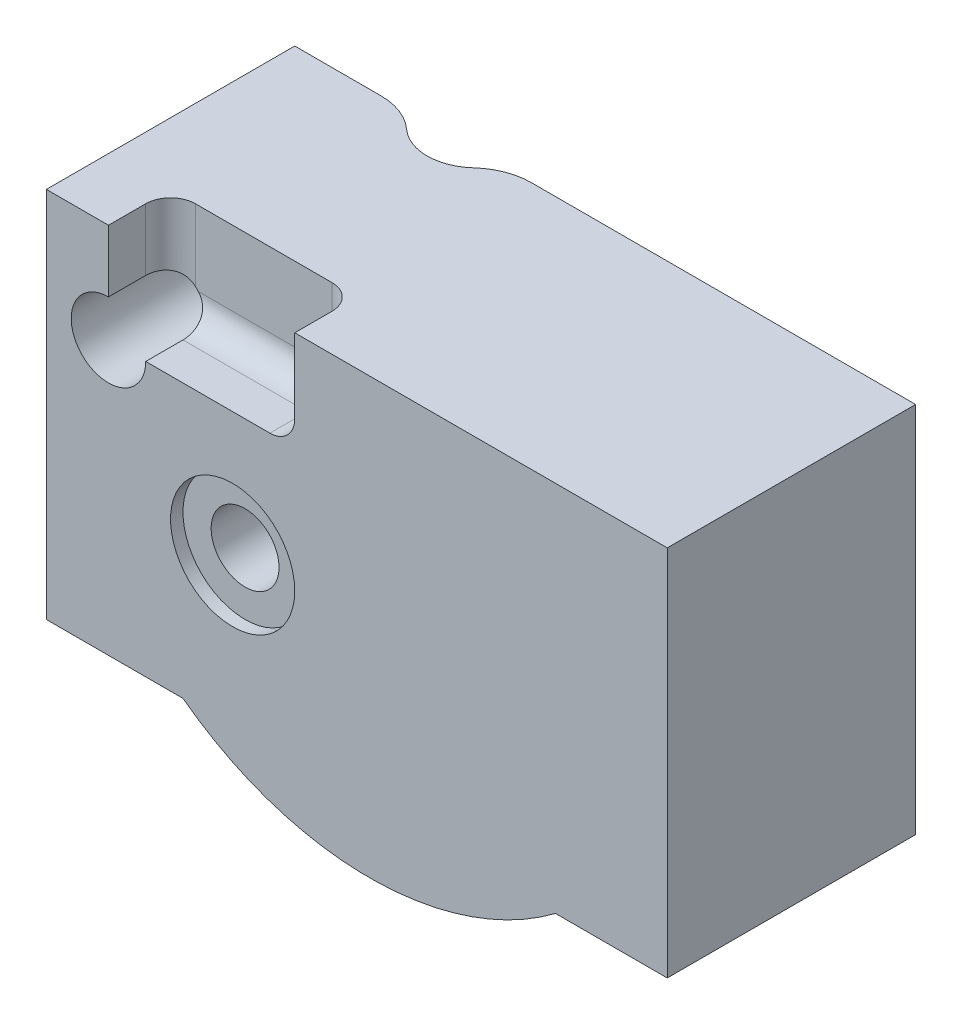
from build123d import *

# Parameters (mm, degrees)
EXTRUDE_1_DEPTH                  = 20
SKETCH_8_R                       = 4
CUT_EXTRUDE_3_DEPTH              = 51.249378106
FILLET_2_R                       = 5
EXTRUDE_2_REACH                  = 43.231
EXTRUDE_2_END_RADIUS             = 10
SKETCH_4_W                       = 1
SKETCH_4_H                       = 1.37957238
EXTRUDE_2_DIRECTION_2_REACH      = 43.231
EXTRUDE_2_DIRECTION_2_END_RADIUS = 10
SKETCH_5_W                       = 15
SKETCH_5_H                       = 8
CUT_EXTRUDE_1_DEPTH              = 5
FILLET_1_R                       = 2
SKETCH_6_R                       = 3
CUT_EXTRUDE_2_DEPTH              = 42.231056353
SKETCH_9_R                       = 2.734702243
CUT_EXTRUDE_4_DEPTH              = 42.231056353
SKETCH_12_R                      = 0.75
FILLET_6_R                       = 0.5
PATTERN_CIRCULAR_1_COUNT         = 3
SKETCH_18_W                      = 22.816802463
SKETCH_18_H                      = 26.047983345
EXTRUDE_4_DEPTH                  = 20


with BuildPart() as part:
    # Sketch 2 → Extrude 1 (new body)
    with BuildSketch(Plane.XY):
        with BuildLine():
            Line((-30, 15), (20, 15))
            Line((20, 15), (20, -15))
            Line((20, -15), (11, -15))
            ThreePointArc((11, -15), (-4, -20), (-19, -15))
            Line((-19, -15), (-30, -15))
            Line((-30, -15), (-30, 15))
        make_face()
    extrude(amount=EXTRUDE_1_DEPTH)

    # Sketch 8 → Cut-Extrude 3 (cut, through all)
    with BuildSketch(Plane(origin=(0, 15, 0), x_dir=(1, 0, 0), z_dir=(0, 1, 0))):
        with Locations((-17, 1.660325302)):
            Circle(SKETCH_8_R)
    extrude(amount=-CUT_EXTRUDE_3_DEPTH, mode=Mode.SUBTRACT)

    # Fillet 2
    fillet_2_edges = [part.edges().sort_by_distance(p)[0] for p in [
        (-20.639137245, 0, 0),
        (-13.360862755, -1.590667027, 0),
    ]]
    fillet(fillet_2_edges, radius=FILLET_2_R)

    # Sketch 3 → Cut-Revolve 1 (revolve, cut)
    with BuildSketch(Plane(origin=(0, 0, 0), x_dir=(1, 0, 0), z_dir=(0, 1, 0))):
        Polygon((0, 0), (-8, 0), (-8, -3.5), (-10, -3.5), (-10, -5.5), (-8, -5.5), (-8, -9), (-10, -9), (-10, -11), (-8, -11), (-8, -14.5), (-10, -14.5), (-10, -16.5), (-8, -16.5), (-8, -20), (0, -20), align=None)
    revolve(axis=Axis((0, 0, 0), (0, 0, 1)), mode=Mode.SUBTRACT)

    # Extrude 2: up to this cylinder (the profile starts inside it)
    extrude_2_end = Plane(origin=(0, 0, 15.5), z_dir=(0, 0, -1)) * Cylinder(EXTRUDE_2_END_RADIUS, 107.462, mode=Mode.PRIVATE)
    # Sketch 4 → Extrude 2 (add, up to the surface)
    with BuildSketch(Plane(origin=(0, 0, 0), x_dir=(0, 0, -1), z_dir=(1, 0, 0)), mode=Mode.PRIVATE) as extrude_2_sk1:
        with Locations((-15.5, 9.99745912)):
            Rectangle(SKETCH_4_W, SKETCH_4_H)
    extrude_2_tool1 = extrude(extrude_2_sk1.sketch, amount=EXTRUDE_2_REACH, mode=Mode.PRIVATE) & extrude_2_end
    add(extrude_2_tool1.solids().sort_by_distance((0, 9.997459, 15.5))[0])

    # Extrude 2 direction 2: up to this cylinder (the profile starts inside it)
    extrude_2_direction_2_end = Plane(origin=(0, 0, 15.5), z_dir=(0, 0, -1)) * Cylinder(EXTRUDE_2_DIRECTION_2_END_RADIUS, 107.462, mode=Mode.PRIVATE)
    # Sketch 4 → Extrude 2 direction 2 (add, up to the surface)
    with BuildSketch(Plane(origin=(0, 0, 0), x_dir=(0, 0, -1), z_dir=(1, 0, 0)), mode=Mode.PRIVATE) as extrude_2_direction_2_sk1:
        with Locations((-15.5, 9.99745912)):
            Rectangle(SKETCH_4_W, SKETCH_4_H)
    extrude_2_direction_2_tool1 = extrude(extrude_2_direction_2_sk1.sketch, amount=-EXTRUDE_2_DIRECTION_2_REACH, mode=Mode.PRIVATE) & extrude_2_direction_2_end
    add(extrude_2_direction_2_tool1.solids().sort_by_distance((0, 9.997459, 15.5))[0])

    # Sketch 5 → Cut-Extrude 1 (cut)
    with BuildSketch(Plane.XY.offset(20)):
        with Locations((-17.5, 11)):
            Rectangle(SKETCH_5_W, SKETCH_5_H)
    extrude(amount=-CUT_EXTRUDE_1_DEPTH, mode=Mode.SUBTRACT)

    # Fillet 1
    fillet_1_edges = [part.edges().sort_by_distance(p)[0] for p in [
        (-25, 11, 15),
        (-25, 7, 17.5),
        (-10, 11, 15),
        (-17.5, 7, 15),
        (-10, 7, 17.5),
    ]]
    fillet(fillet_1_edges, radius=FILLET_1_R)

    # Sketch 6 → Cut-Extrude 2 (cut, through all)
    with BuildSketch(Plane.XY.offset(20)):
        with Locations((-25, 7)):
            Circle(SKETCH_6_R)
    extrude(amount=-CUT_EXTRUDE_2_DEPTH, mode=Mode.SUBTRACT)

    # Sketch 9 → Cut-Extrude 4 (cut, through all)
    with BuildSketch(Plane.XY.offset(20)):
        with Locations((-15, -3)):
            Circle(SKETCH_9_R)
    extrude(amount=-CUT_EXTRUDE_4_DEPTH, mode=Mode.SUBTRACT)

    # Sketch 10 → Cut-Revolve 4 (revolve, cut)
    with BuildSketch(Plane(origin=(-15, 0, 0), x_dir=(0, 0, -1), z_dir=(1, 0, 0)), mode=Mode.PRIVATE) as cut_revolve_4_sk:
        Polygon((-19, -5), (0, -5), (0, -3), (-20, -3), (-20, -8), (-19, -8), align=None)
    revolve(cut_revolve_4_sk.sketch.rotate(Axis((-15, -3, 20), (0, 0, -1)), 345.379782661), axis=Axis((-15, -3, 20), (0, 0, -1)), mode=Mode.SUBTRACT)


with BuildPart() as body_2:
    # Sweep 1: sweep along a path in Sketch 11
    with BuildLine(Plane(origin=(-15, 0, 0), x_dir=(0, 0, -1), z_dir=(1, 0, 0))) as sweep_1_path:
        Line((-17, 1), (-16, 1))
        ThreePointArc((-16, 1), (-14.585786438, 0.414213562), (-14, -1))
        Line((-14, -1), (-14, -5))
        ThreePointArc((-14, -5), (-14.585786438, -6.414213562), (-16, -7))
        Line((-16, -7), (-17, -7))
    # Sketch 12 → Sweep 1 (sweep)
    with BuildSketch(Plane(origin=(-15, 1, 17), x_dir=(-1, 0, 0), z_dir=(0, 0, -1))):
        with Locations((0.001816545, 0.017168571)):
            Circle(SKETCH_12_R)
    sweep(path=sweep_1_path.line)

    # Fillet 6
    fillet_6_edges = [body_2.edges().sort_by_distance(p)[0] for p in [
        (-14.251816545, 1.017168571, 17),
        (-14.251816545, -7.017168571, 17),
    ]]
    fillet(fillet_6_edges, radius=FILLET_6_R)


with BuildPart() as body_3:
    # Mirror 1: mirrored copy
    add(body_2.part.mirror(Plane.XY.offset(13)))


with BuildPart() as pattern_circular_1_1:
    # Pattern Circular 1: pattern copy
    add(body_3.part.rotate(Axis((-15, -3, 0), (0, 0, 1)), 1 * 360 / PATTERN_CIRCULAR_1_COUNT))


with BuildPart() as pattern_circular_1_2:
    # Pattern Circular 1: pattern copy
    add(body_3.part.rotate(Axis((-15, -3, 0), (0, 0, 1)), 2 * 360 / PATTERN_CIRCULAR_1_COUNT))


with BuildPart() as pattern_circular_1_3:
    # Pattern Circular 1: pattern copy
    add(body_2.part.rotate(Axis((-15, -3, 0), (0, 0, 1)), 1 * 360 / PATTERN_CIRCULAR_1_COUNT))


with BuildPart() as pattern_circular_1_4:
    # Pattern Circular 1: pattern copy
    add(body_2.part.rotate(Axis((-15, -3, 0), (0, 0, 1)), 2 * 360 / PATTERN_CIRCULAR_1_COUNT))


with BuildPart() as part_1:
    add(part.part)

    # Combine 1: cut body 2, Pattern Circular 1_4, Pattern Circular 1_3, Pattern Circular 1_1, body 3, Pattern Circular 1_2
    add(body_2.part, mode=Mode.SUBTRACT)
    add(pattern_circular_1_4.part, mode=Mode.SUBTRACT)
    add(pattern_circular_1_3.part, mode=Mode.SUBTRACT)
    add(pattern_circular_1_1.part, mode=Mode.SUBTRACT)
    add(body_3.part, mode=Mode.SUBTRACT)
    add(pattern_circular_1_2.part, mode=Mode.SUBTRACT)

    # Sketch 18 → Extrude 4 (add)
    with BuildSketch(Plane.XY.offset(20)):
        with Locations((2.128098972, -0.796695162)):
            Rectangle(SKETCH_18_W, SKETCH_18_H)
    extrude(amount=-EXTRUDE_4_DEPTH)


solid = part_1.part
